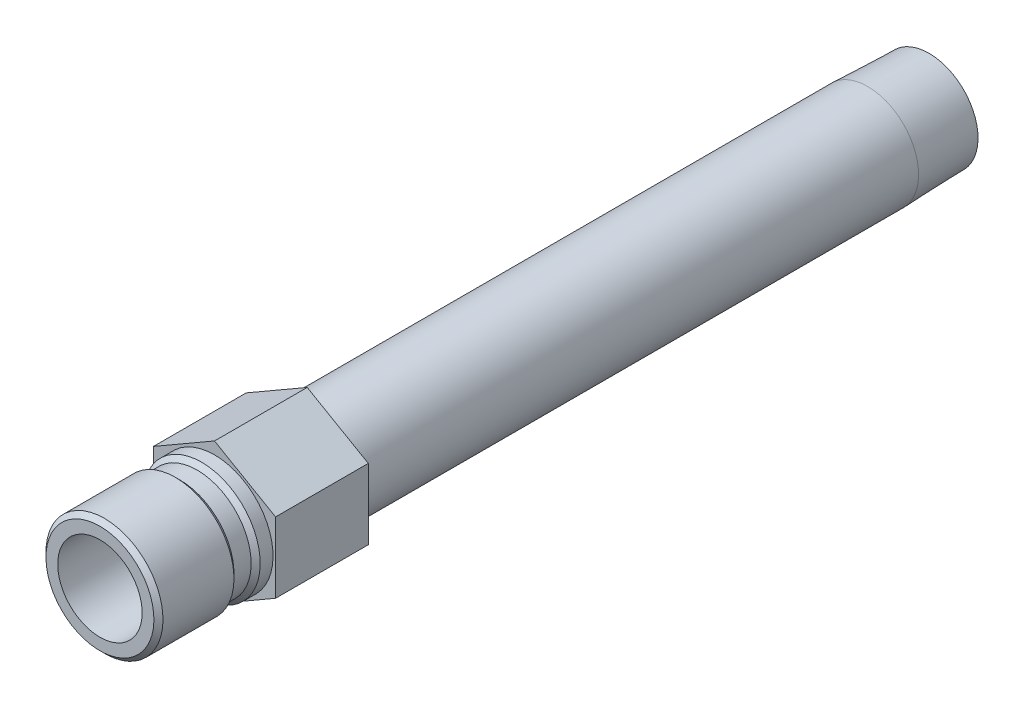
ISO-10303-21;
HEADER;
FILE_DESCRIPTION(('STEP AP214'),'2;1');
FILE_NAME('part.step','',(''),(''),'','','');
FILE_SCHEMA(('AUTOMOTIVE_DESIGN { 1 0 10303 214 1 1 1 1 }'));
ENDSEC;
DATA;
#1=APPLICATION_CONTEXT('core data for automotive mechanical design processes');
#2=APPLICATION_PROTOCOL_DEFINITION('international standard','automotive_design',2000,#1);
#3=PRODUCT_CONTEXT('',#1,'mechanical');
#4=PRODUCT('Part','Part','',(#3));
#5=PRODUCT_RELATED_PRODUCT_CATEGORY('part','',(#4));
#6=PRODUCT_DEFINITION_FORMATION('','',#4);
#7=PRODUCT_DEFINITION_CONTEXT('part definition',#1,'design');
#8=PRODUCT_DEFINITION('design','',#6,#7);
#9=PRODUCT_DEFINITION_SHAPE('','',#8);
#10=(LENGTH_UNIT() NAMED_UNIT(*) SI_UNIT(.MILLI.,.METRE.));
#11=(NAMED_UNIT(*) PLANE_ANGLE_UNIT() SI_UNIT($,.RADIAN.));
#12=(NAMED_UNIT(*) SI_UNIT($,.STERADIAN.) SOLID_ANGLE_UNIT());
#13=UNCERTAINTY_MEASURE_WITH_UNIT(LENGTH_MEASURE(1.E-05),#10,'distance_accuracy_value','');
#14=(GEOMETRIC_REPRESENTATION_CONTEXT(3) GLOBAL_UNCERTAINTY_ASSIGNED_CONTEXT((#13)) GLOBAL_UNIT_ASSIGNED_CONTEXT((#10,
#11,#12)) REPRESENTATION_CONTEXT('',''));
#15=CARTESIAN_POINT('',(0.,0.,0.));
#16=DIRECTION('',(0.,0.,1.));
#17=DIRECTION('',(1.,0.,0.));
#18=AXIS2_PLACEMENT_3D('',#15,#16,#17);
#19=CARTESIAN_POINT('',(0.,0.,0.));
#20=DIRECTION('',(0.,0.,-1.));
#21=DIRECTION('',(0.,1.,0.));
#22=AXIS2_PLACEMENT_3D('',#19,#20,#21);
#23=CYLINDRICAL_SURFACE('',#22,8.5725);
#24=CARTESIAN_POINT('',(0.,0.,-110.0582));
#25=DIRECTION('',(0.,0.,-1.));
#26=DIRECTION('',(0.,1.,0.));
#27=AXIS2_PLACEMENT_3D('',#24,#25,#26);
#28=CIRCLE('',#27,8.5725);
#29=CARTESIAN_POINT('',(0.,8.5725,-110.0582));
#30=VERTEX_POINT('',#29);
#31=EDGE_CURVE('E158',#30,#30,#28,.T.);
#32=ORIENTED_EDGE('',*,*,#31,.F.);
#33=EDGE_LOOP('',(#32));
#34=FACE_BOUND('',#33,.T.);
#35=CARTESIAN_POINT('',(0.,0.,-15.621));
#36=DIRECTION('',(0.,0.,1.));
#37=DIRECTION('',(1.,0.,0.));
#38=AXIS2_PLACEMENT_3D('',#35,#36,#37);
#39=CIRCLE('',#38,8.5725);
#40=CARTESIAN_POINT('',(8.5725,0.,-15.621));
#41=VERTEX_POINT('',#40);
#42=EDGE_CURVE('E39',#41,#41,#39,.F.);
#43=ORIENTED_EDGE('',*,*,#42,.T.);
#44=EDGE_LOOP('',(#43));
#45=FACE_BOUND('',#44,.T.);
#46=ADVANCED_FACE('F35',(#34,#45),#23,.T.);
#47=CARTESIAN_POINT('',(0.,0.,0.));
#48=DIRECTION('',(0.,0.,-1.));
#49=DIRECTION('',(0.,1.,0.));
#50=AXIS2_PLACEMENT_3D('',#47,#48,#49);
#51=CYLINDRICAL_SURFACE('',#50,7.112);
#52=CARTESIAN_POINT('',(0.,0.,1.524));
#53=DIRECTION('',(0.,0.,-1.));
#54=DIRECTION('',(0.,1.,0.));
#55=AXIS2_PLACEMENT_3D('',#52,#53,#54);
#56=CIRCLE('',#55,7.112);
#57=CARTESIAN_POINT('',(0.,7.112,1.524));
#58=VERTEX_POINT('',#57);
#59=EDGE_CURVE('E146',#58,#58,#56,.T.);
#60=ORIENTED_EDGE('',*,*,#59,.T.);
#61=EDGE_LOOP('',(#60));
#62=FACE_BOUND('',#61,.T.);
#63=CARTESIAN_POINT('',(0.,0.,19.304));
#64=DIRECTION('',(0.,0.,-1.));
#65=DIRECTION('',(0.,1.,0.));
#66=AXIS2_PLACEMENT_3D('',#63,#64,#65);
#67=CIRCLE('',#66,7.112);
#68=CARTESIAN_POINT('',(0.,7.112,19.304));
#69=VERTEX_POINT('',#68);
#70=EDGE_CURVE('E11',#69,#69,#67,.T.);
#71=ORIENTED_EDGE('',*,*,#70,.F.);
#72=EDGE_LOOP('',(#71));
#73=FACE_BOUND('',#72,.T.);
#74=ADVANCED_FACE('F37',(#62,#73),#51,.F.);
#75=CARTESIAN_POINT('',(0.,7.112,19.304));
#76=DIRECTION('',(0.,0.,1.));
#77=DIRECTION('',(0.,-1.,0.));
#78=AXIS2_PLACEMENT_3D('',#75,#76,#77);
#79=PLANE('',#78);
#80=ORIENTED_EDGE('',*,*,#70,.T.);
#81=EDGE_LOOP('',(#80));
#82=FACE_BOUND('',#81,.T.);
#83=CARTESIAN_POINT('',(0.,0.,19.304));
#84=DIRECTION('',(0.,0.,-1.));
#85=DIRECTION('',(0.,1.,0.));
#86=AXIS2_PLACEMENT_3D('',#83,#84,#85);
#87=CIRCLE('',#86,9.09319999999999);
#88=CARTESIAN_POINT('',(0.,9.0932,19.304));
#89=VERTEX_POINT('',#88);
#90=EDGE_CURVE('E45',#89,#89,#87,.T.);
#91=ORIENTED_EDGE('',*,*,#90,.F.);
#92=EDGE_LOOP('',(#91));
#93=FACE_BOUND('',#92,.T.);
#94=ADVANCED_FACE('F185',(#82,#93),#79,.T.);
#95=CARTESIAN_POINT('',(0.,0.,18.542));
#96=DIRECTION('',(0.,0.,-1.));
#97=DIRECTION('',(0.,1.,0.));
#98=AXIS2_PLACEMENT_3D('',#95,#96,#97);
#99=CONICAL_SURFACE('',#98,9.8552,0.785398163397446);
#100=ORIENTED_EDGE('',*,*,#90,.T.);
#101=EDGE_LOOP('',(#100));
#102=FACE_BOUND('',#101,.T.);
#103=CARTESIAN_POINT('',(0.,0.,18.542));
#104=DIRECTION('',(0.,0.,-1.));
#105=DIRECTION('',(0.,1.,0.));
#106=AXIS2_PLACEMENT_3D('',#103,#104,#105);
#107=CIRCLE('',#106,9.8552);
#108=CARTESIAN_POINT('',(0.,9.8552,18.542));
#109=VERTEX_POINT('',#108);
#110=EDGE_CURVE('E176',#109,#109,#107,.T.);
#111=ORIENTED_EDGE('',*,*,#110,.F.);
#112=EDGE_LOOP('',(#111));
#113=FACE_BOUND('',#112,.T.);
#114=ADVANCED_FACE('F182',(#102,#113),#99,.T.);
#115=CARTESIAN_POINT('',(0.,0.,0.));
#116=DIRECTION('',(0.,0.,-1.));
#117=DIRECTION('',(0.,1.,0.));
#118=AXIS2_PLACEMENT_3D('',#115,#116,#117);
#119=CYLINDRICAL_SURFACE('',#118,9.8552);
#120=ORIENTED_EDGE('',*,*,#110,.T.);
#121=EDGE_LOOP('',(#120));
#122=FACE_BOUND('',#121,.T.);
#123=CARTESIAN_POINT('',(0.,0.,6.5786));
#124=DIRECTION('',(0.,0.,-1.));
#125=DIRECTION('',(0.,1.,0.));
#126=AXIS2_PLACEMENT_3D('',#123,#124,#125);
#127=CIRCLE('',#126,9.8552);
#128=CARTESIAN_POINT('',(0.,9.8552,6.5786));
#129=VERTEX_POINT('',#128);
#130=EDGE_CURVE('E173',#129,#129,#127,.T.);
#131=ORIENTED_EDGE('',*,*,#130,.F.);
#132=EDGE_LOOP('',(#131));
#133=FACE_BOUND('',#132,.T.);
#134=ADVANCED_FACE('F192',(#122,#133),#119,.T.);
#135=CARTESIAN_POINT('',(0.,0.,5.8166));
#136=DIRECTION('',(0.,0.,1.));
#137=DIRECTION('',(0.,-1.,0.));
#138=AXIS2_PLACEMENT_3D('',#135,#136,#137);
#139=CONICAL_SURFACE('',#138,9.0932,0.785398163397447);
#140=ORIENTED_EDGE('',*,*,#130,.T.);
#141=EDGE_LOOP('',(#140));
#142=FACE_BOUND('',#141,.T.);
#143=CARTESIAN_POINT('',(0.,0.,5.8166));
#144=DIRECTION('',(0.,0.,-1.));
#145=DIRECTION('',(0.,1.,0.));
#146=AXIS2_PLACEMENT_3D('',#143,#144,#145);
#147=CIRCLE('',#146,9.0932);
#148=CARTESIAN_POINT('',(0.,9.0932,5.8166));
#149=VERTEX_POINT('',#148);
#150=EDGE_CURVE('E170',#149,#149,#147,.T.);
#151=ORIENTED_EDGE('',*,*,#150,.F.);
#152=EDGE_LOOP('',(#151));
#153=FACE_BOUND('',#152,.T.);
#154=ADVANCED_FACE('F217',(#142,#153),#139,.T.);
#155=CARTESIAN_POINT('',(0.,0.,0.));
#156=DIRECTION('',(0.,0.,-1.));
#157=DIRECTION('',(0.,1.,0.));
#158=AXIS2_PLACEMENT_3D('',#155,#156,#157);
#159=CYLINDRICAL_SURFACE('',#158,9.0932);
#160=ORIENTED_EDGE('',*,*,#150,.T.);
#161=EDGE_LOOP('',(#160));
#162=FACE_BOUND('',#161,.T.);
#163=CARTESIAN_POINT('',(0.,0.,2.921));
#164=DIRECTION('',(0.,0.,-1.));
#165=DIRECTION('',(0.,1.,0.));
#166=AXIS2_PLACEMENT_3D('',#163,#164,#165);
#167=CIRCLE('',#166,9.0932);
#168=CARTESIAN_POINT('',(0.,9.0932,2.921));
#169=VERTEX_POINT('',#168);
#170=EDGE_CURVE('E167',#169,#169,#167,.T.);
#171=ORIENTED_EDGE('',*,*,#170,.F.);
#172=EDGE_LOOP('',(#171));
#173=FACE_BOUND('',#172,.T.);
#174=ADVANCED_FACE('F213',(#162,#173),#159,.T.);
#175=CARTESIAN_POINT('',(0.,0.,2.159));
#176=DIRECTION('',(0.,0.,-1.));
#177=DIRECTION('',(0.,1.,0.));
#178=AXIS2_PLACEMENT_3D('',#175,#176,#177);
#179=CONICAL_SURFACE('',#178,9.8552,0.785398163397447);
#180=ORIENTED_EDGE('',*,*,#170,.T.);
#181=EDGE_LOOP('',(#180));
#182=FACE_BOUND('',#181,.T.);
#183=CARTESIAN_POINT('',(0.,0.,2.159));
#184=DIRECTION('',(0.,0.,-1.));
#185=DIRECTION('',(0.,1.,0.));
#186=AXIS2_PLACEMENT_3D('',#183,#184,#185);
#187=CIRCLE('',#186,9.8552);
#188=CARTESIAN_POINT('',(0.,9.8552,2.159));
#189=VERTEX_POINT('',#188);
#190=EDGE_CURVE('E164',#189,#189,#187,.T.);
#191=ORIENTED_EDGE('',*,*,#190,.F.);
#192=EDGE_LOOP('',(#191));
#193=FACE_BOUND('',#192,.T.);
#194=ADVANCED_FACE('F209',(#182,#193),#179,.T.);
#195=CARTESIAN_POINT('',(0.,0.,0.));
#196=DIRECTION('',(0.,0.,-1.));
#197=DIRECTION('',(0.,1.,0.));
#198=AXIS2_PLACEMENT_3D('',#195,#196,#197);
#199=CYLINDRICAL_SURFACE('',#198,9.8552);
#200=ORIENTED_EDGE('',*,*,#190,.T.);
#201=EDGE_LOOP('',(#200));
#202=FACE_BOUND('',#201,.T.);
#203=CARTESIAN_POINT('',(0.,0.,0.));
#204=DIRECTION('',(0.,0.,-1.));
#205=DIRECTION('',(0.,1.,0.));
#206=AXIS2_PLACEMENT_3D('',#203,#204,#205);
#207=CIRCLE('',#206,9.8552);
#208=CARTESIAN_POINT('',(0.,9.8552,0.));
#209=VERTEX_POINT('',#208);
#210=EDGE_CURVE('E161',#209,#209,#207,.T.);
#211=ORIENTED_EDGE('',*,*,#210,.F.);
#212=EDGE_LOOP('',(#211));
#213=FACE_BOUND('',#212,.T.);
#214=ADVANCED_FACE('F206',(#202,#213),#199,.T.);
#215=CARTESIAN_POINT('',(0.,0.,-120.396));
#216=DIRECTION('',(0.,0.,1.));
#217=DIRECTION('',(0.,-1.,0.));
#218=AXIS2_PLACEMENT_3D('',#215,#216,#217);
#219=CONICAL_SURFACE('',#218,8.24944566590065,0.0312396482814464);
#220=ORIENTED_EDGE('',*,*,#31,.T.);
#221=EDGE_LOOP('',(#220));
#222=FACE_BOUND('',#221,.T.);
#223=CARTESIAN_POINT('',(0.,0.,-120.396));
#224=DIRECTION('',(0.,0.,-1.));
#225=DIRECTION('',(0.,1.,0.));
#226=AXIS2_PLACEMENT_3D('',#223,#224,#225);
#227=CIRCLE('',#226,8.24944566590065);
#228=CARTESIAN_POINT('',(0.,8.24944566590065,-120.396));
#229=VERTEX_POINT('',#228);
#230=EDGE_CURVE('E155',#229,#229,#227,.T.);
#231=ORIENTED_EDGE('',*,*,#230,.F.);
#232=EDGE_LOOP('',(#231));
#233=FACE_BOUND('',#232,.T.);
#234=ADVANCED_FACE('F204',(#222,#233),#219,.T.);
#235=CARTESIAN_POINT('',(0.,8.24944566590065,-120.396));
#236=DIRECTION('',(0.,0.,-1.));
#237=DIRECTION('',(0.,1.,0.));
#238=AXIS2_PLACEMENT_3D('',#235,#236,#237);
#239=PLANE('',#238);
#240=ORIENTED_EDGE('',*,*,#230,.T.);
#241=EDGE_LOOP('',(#240));
#242=FACE_BOUND('',#241,.T.);
#243=CARTESIAN_POINT('',(0.,0.,-120.396));
#244=DIRECTION('',(0.,0.,-1.));
#245=DIRECTION('',(0.,1.,0.));
#246=AXIS2_PLACEMENT_3D('',#243,#244,#245);
#247=CIRCLE('',#246,6.2611);
#248=CARTESIAN_POINT('',(0.,6.2611,-120.396));
#249=VERTEX_POINT('',#248);
#250=EDGE_CURVE('E152',#249,#249,#247,.T.);
#251=ORIENTED_EDGE('',*,*,#250,.F.);
#252=EDGE_LOOP('',(#251));
#253=FACE_BOUND('',#252,.T.);
#254=ADVANCED_FACE('F270',(#242,#253),#239,.T.);
#255=CARTESIAN_POINT('',(0.,0.,0.));
#256=DIRECTION('',(0.,0.,-1.));
#257=DIRECTION('',(0.,1.,0.));
#258=AXIS2_PLACEMENT_3D('',#255,#256,#257);
#259=CYLINDRICAL_SURFACE('',#258,6.2611);
#260=ORIENTED_EDGE('',*,*,#250,.T.);
#261=EDGE_LOOP('',(#260));
#262=FACE_BOUND('',#261,.T.);
#263=CARTESIAN_POINT('',(0.,0.,1.07156844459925));
#264=DIRECTION('',(0.,0.,-1.));
#265=DIRECTION('',(0.,1.,0.));
#266=AXIS2_PLACEMENT_3D('',#263,#264,#265);
#267=CIRCLE('',#266,6.2611);
#268=CARTESIAN_POINT('',(0.,6.2611,1.07156844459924));
#269=VERTEX_POINT('',#268);
#270=EDGE_CURVE('E149',#269,#269,#267,.T.);
#271=ORIENTED_EDGE('',*,*,#270,.F.);
#272=EDGE_LOOP('',(#271));
#273=FACE_BOUND('',#272,.T.);
#274=ADVANCED_FACE('F267',(#262,#273),#259,.F.);
#275=CARTESIAN_POINT('',(0.,0.,1.524));
#276=DIRECTION('',(0.,0.,1.));
#277=DIRECTION('',(0.,-1.,0.));
#278=AXIS2_PLACEMENT_3D('',#275,#276,#277);
#279=CONICAL_SURFACE('',#278,7.112,1.08210413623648);
#280=ORIENTED_EDGE('',*,*,#270,.T.);
#281=EDGE_LOOP('',(#280));
#282=FACE_BOUND('',#281,.T.);
#283=ORIENTED_EDGE('',*,*,#59,.F.);
#284=EDGE_LOOP('',(#283));
#285=FACE_BOUND('',#284,.T.);
#286=ADVANCED_FACE('F255',(#282,#285),#279,.F.);
#287=CARTESIAN_POINT('',(0.,11.8784044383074,-15.621));
#288=DIRECTION('',(-0.5,0.866025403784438,0.));
#289=DIRECTION('',(-0.866025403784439,-0.5,0.));
#290=AXIS2_PLACEMENT_3D('',#287,#288,#289);
#291=PLANE('',#290);
#292=DIRECTION('',(-0.866025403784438,-0.5,0.));
#293=VECTOR('',#292,1.);
#294=CARTESIAN_POINT('',(0.,11.8784044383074,0.));
#295=LINE('',#294,#293);
#296=CARTESIAN_POINT('',(0.,11.8784044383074,0.));
#297=VERTEX_POINT('',#296);
#298=CARTESIAN_POINT('',(-10.287,5.93920221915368,0.));
#299=VERTEX_POINT('',#298);
#300=EDGE_CURVE('E124',#297,#299,#295,.T.);
#301=ORIENTED_EDGE('',*,*,#300,.F.);
#302=DIRECTION('',(0.,0.,1.));
#303=VECTOR('',#302,1.);
#304=CARTESIAN_POINT('',(0.,11.8784044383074,-15.621));
#305=LINE('',#304,#303);
#306=CARTESIAN_POINT('',(0.,11.8784044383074,-15.621));
#307=VERTEX_POINT('',#306);
#308=EDGE_CURVE('E53',#307,#297,#305,.T.);
#309=ORIENTED_EDGE('',*,*,#308,.F.);
#310=DIRECTION('',(-0.866025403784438,-0.5,0.));
#311=VECTOR('',#310,1.);
#312=CARTESIAN_POINT('',(0.,11.8784044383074,-15.621));
#313=LINE('',#312,#311);
#314=CARTESIAN_POINT('',(-10.287,5.93920221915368,-15.621));
#315=VERTEX_POINT('',#314);
#316=EDGE_CURVE('E139',#307,#315,#313,.T.);
#317=ORIENTED_EDGE('',*,*,#316,.T.);
#318=DIRECTION('',(0.,0.,1.));
#319=VECTOR('',#318,1.);
#320=CARTESIAN_POINT('',(-10.287,5.93920221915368,-15.621));
#321=LINE('',#320,#319);
#322=EDGE_CURVE('E88',#315,#299,#321,.T.);
#323=ORIENTED_EDGE('',*,*,#322,.T.);
#324=EDGE_LOOP('',(#301,#309,#317,#323));
#325=FACE_BOUND('',#324,.T.);
#326=ADVANCED_FACE('F242',(#325),#291,.T.);
#327=CARTESIAN_POINT('',(10.287,5.93920221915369,-15.621));
#328=DIRECTION('',(0.5,0.866025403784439,0.));
#329=DIRECTION('',(-0.866025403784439,0.5,0.));
#330=AXIS2_PLACEMENT_3D('',#327,#328,#329);
#331=PLANE('',#330);
#332=DIRECTION('',(-0.866025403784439,0.5,0.));
#333=VECTOR('',#332,1.);
#334=CARTESIAN_POINT('',(10.287,5.93920221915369,0.));
#335=LINE('',#334,#333);
#336=CARTESIAN_POINT('',(10.287,5.93920221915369,0.));
#337=VERTEX_POINT('',#336);
#338=EDGE_CURVE('E136',#337,#297,#335,.T.);
#339=ORIENTED_EDGE('',*,*,#338,.F.);
#340=DIRECTION('',(0.,0.,1.));
#341=VECTOR('',#340,1.);
#342=CARTESIAN_POINT('',(10.287,5.93920221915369,-15.621));
#343=LINE('',#342,#341);
#344=CARTESIAN_POINT('',(10.287,5.93920221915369,-15.621));
#345=VERTEX_POINT('',#344);
#346=EDGE_CURVE('E76',#345,#337,#343,.T.);
#347=ORIENTED_EDGE('',*,*,#346,.F.);
#348=DIRECTION('',(-0.866025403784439,0.5,0.));
#349=VECTOR('',#348,1.);
#350=CARTESIAN_POINT('',(10.287,5.93920221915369,-15.621));
#351=LINE('',#350,#349);
#352=EDGE_CURVE('E114',#345,#307,#351,.T.);
#353=ORIENTED_EDGE('',*,*,#352,.T.);
#354=ORIENTED_EDGE('',*,*,#308,.T.);
#355=EDGE_LOOP('',(#339,#347,#353,#354));
#356=FACE_BOUND('',#355,.T.);
#357=ADVANCED_FACE('F247',(#356),#331,.T.);
#358=CARTESIAN_POINT('',(10.287,-5.93920221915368,-15.621));
#359=DIRECTION('',(1.,0.,0.));
#360=DIRECTION('',(0.,0.,-1.));
#361=AXIS2_PLACEMENT_3D('',#358,#359,#360);
#362=PLANE('',#361);
#363=DIRECTION('',(0.,1.,0.));
#364=VECTOR('',#363,1.);
#365=CARTESIAN_POINT('',(10.287,-5.93920221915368,0.));
#366=LINE('',#365,#364);
#367=CARTESIAN_POINT('',(10.287,-5.93920221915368,0.));
#368=VERTEX_POINT('',#367);
#369=EDGE_CURVE('E101',#368,#337,#366,.T.);
#370=ORIENTED_EDGE('',*,*,#369,.F.);
#371=DIRECTION('',(0.,0.,1.));
#372=VECTOR('',#371,1.);
#373=CARTESIAN_POINT('',(10.287,-5.93920221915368,-15.621));
#374=LINE('',#373,#372);
#375=CARTESIAN_POINT('',(10.287,-5.93920221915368,-15.621));
#376=VERTEX_POINT('',#375);
#377=EDGE_CURVE('E96',#376,#368,#374,.T.);
#378=ORIENTED_EDGE('',*,*,#377,.F.);
#379=DIRECTION('',(0.,1.,0.));
#380=VECTOR('',#379,1.);
#381=CARTESIAN_POINT('',(10.287,-5.93920221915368,-15.621));
#382=LINE('',#381,#380);
#383=EDGE_CURVE('E99',#376,#345,#382,.T.);
#384=ORIENTED_EDGE('',*,*,#383,.T.);
#385=ORIENTED_EDGE('',*,*,#346,.T.);
#386=EDGE_LOOP('',(#370,#378,#384,#385));
#387=FACE_BOUND('',#386,.T.);
#388=ADVANCED_FACE('F98',(#387),#362,.T.);
#389=CARTESIAN_POINT('',(0.,-11.8784044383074,-15.621));
#390=DIRECTION('',(0.5,-0.866025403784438,0.));
#391=DIRECTION('',(0.866025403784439,0.5,0.));
#392=AXIS2_PLACEMENT_3D('',#389,#390,#391);
#393=PLANE('',#392);
#394=DIRECTION('',(0.866025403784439,0.5,0.));
#395=VECTOR('',#394,1.);
#396=CARTESIAN_POINT('',(0.,-11.8784044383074,0.));
#397=LINE('',#396,#395);
#398=CARTESIAN_POINT('',(0.,-11.8784044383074,0.));
#399=VERTEX_POINT('',#398);
#400=EDGE_CURVE('E133',#399,#368,#397,.T.);
#401=ORIENTED_EDGE('',*,*,#400,.F.);
#402=DIRECTION('',(0.,0.,1.));
#403=VECTOR('',#402,1.);
#404=CARTESIAN_POINT('',(0.,-11.8784044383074,-15.621));
#405=LINE('',#404,#403);
#406=CARTESIAN_POINT('',(0.,-11.8784044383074,-15.621));
#407=VERTEX_POINT('',#406);
#408=EDGE_CURVE('E106',#407,#399,#405,.T.);
#409=ORIENTED_EDGE('',*,*,#408,.F.);
#410=DIRECTION('',(0.866025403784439,0.5,0.));
#411=VECTOR('',#410,1.);
#412=CARTESIAN_POINT('',(0.,-11.8784044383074,-15.621));
#413=LINE('',#412,#411);
#414=EDGE_CURVE('E112',#407,#376,#413,.T.);
#415=ORIENTED_EDGE('',*,*,#414,.T.);
#416=ORIENTED_EDGE('',*,*,#377,.T.);
#417=EDGE_LOOP('',(#401,#409,#415,#416));
#418=FACE_BOUND('',#417,.T.);
#419=ADVANCED_FACE('F116',(#418),#393,.T.);
#420=CARTESIAN_POINT('',(-10.287,-5.93920221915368,-15.621));
#421=DIRECTION('',(-0.5,-0.866025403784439,0.));
#422=DIRECTION('',(0.866025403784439,-0.5,0.));
#423=AXIS2_PLACEMENT_3D('',#420,#421,#422);
#424=PLANE('',#423);
#425=DIRECTION('',(0.866025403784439,-0.5,0.));
#426=VECTOR('',#425,1.);
#427=CARTESIAN_POINT('',(-10.287,-5.93920221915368,0.));
#428=LINE('',#427,#426);
#429=CARTESIAN_POINT('',(-10.287,-5.93920221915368,0.));
#430=VERTEX_POINT('',#429);
#431=EDGE_CURVE('E130',#430,#399,#428,.T.);
#432=ORIENTED_EDGE('',*,*,#431,.F.);
#433=DIRECTION('',(0.,0.,1.));
#434=VECTOR('',#433,1.);
#435=CARTESIAN_POINT('',(-10.287,-5.93920221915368,-15.621));
#436=LINE('',#435,#434);
#437=CARTESIAN_POINT('',(-10.287,-5.93920221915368,-15.621));
#438=VERTEX_POINT('',#437);
#439=EDGE_CURVE('E143',#438,#430,#436,.T.);
#440=ORIENTED_EDGE('',*,*,#439,.F.);
#441=DIRECTION('',(0.866025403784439,-0.5,0.));
#442=VECTOR('',#441,1.);
#443=CARTESIAN_POINT('',(-10.287,-5.93920221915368,-15.621));
#444=LINE('',#443,#442);
#445=EDGE_CURVE('E117',#438,#407,#444,.T.);
#446=ORIENTED_EDGE('',*,*,#445,.T.);
#447=ORIENTED_EDGE('',*,*,#408,.T.);
#448=EDGE_LOOP('',(#432,#440,#446,#447));
#449=FACE_BOUND('',#448,.T.);
#450=ADVANCED_FACE('F246',(#449),#424,.T.);
#451=CARTESIAN_POINT('',(-10.287,5.93920221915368,-15.621));
#452=DIRECTION('',(-1.,0.,0.));
#453=DIRECTION('',(0.,0.,1.));
#454=AXIS2_PLACEMENT_3D('',#451,#452,#453);
#455=PLANE('',#454);
#456=DIRECTION('',(0.,-1.,0.));
#457=VECTOR('',#456,1.);
#458=CARTESIAN_POINT('',(-10.287,5.93920221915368,0.));
#459=LINE('',#458,#457);
#460=EDGE_CURVE('E127',#299,#430,#459,.T.);
#461=ORIENTED_EDGE('',*,*,#460,.F.);
#462=ORIENTED_EDGE('',*,*,#322,.F.);
#463=DIRECTION('',(0.,-1.,0.));
#464=VECTOR('',#463,1.);
#465=CARTESIAN_POINT('',(-10.287,5.93920221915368,-15.621));
#466=LINE('',#465,#464);
#467=EDGE_CURVE('E119',#315,#438,#466,.T.);
#468=ORIENTED_EDGE('',*,*,#467,.T.);
#469=ORIENTED_EDGE('',*,*,#439,.T.);
#470=EDGE_LOOP('',(#461,#462,#468,#469));
#471=FACE_BOUND('',#470,.T.);
#472=ADVANCED_FACE('F243',(#471),#455,.T.);
#473=CARTESIAN_POINT('',(-10.287,5.93920221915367,-15.621));
#474=DIRECTION('',(0.,0.,1.));
#475=DIRECTION('',(1.,0.,0.));
#476=AXIS2_PLACEMENT_3D('',#473,#474,#475);
#477=PLANE('',#476);
#478=ORIENTED_EDGE('',*,*,#42,.F.);
#479=EDGE_LOOP('',(#478));
#480=FACE_BOUND('',#479,.T.);
#481=ORIENTED_EDGE('',*,*,#316,.F.);
#482=ORIENTED_EDGE('',*,*,#352,.F.);
#483=ORIENTED_EDGE('',*,*,#383,.F.);
#484=ORIENTED_EDGE('',*,*,#414,.F.);
#485=ORIENTED_EDGE('',*,*,#445,.F.);
#486=ORIENTED_EDGE('',*,*,#467,.F.);
#487=EDGE_LOOP('',(#481,#482,#483,#484,#485,#486));
#488=FACE_BOUND('',#487,.T.);
#489=ADVANCED_FACE('F110',(#480,#488),#477,.F.);
#490=CARTESIAN_POINT('',(-10.287,5.93920221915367,0.));
#491=DIRECTION('',(0.,0.,1.));
#492=DIRECTION('',(1.,0.,0.));
#493=AXIS2_PLACEMENT_3D('',#490,#491,#492);
#494=PLANE('',#493);
#495=ORIENTED_EDGE('',*,*,#210,.T.);
#496=EDGE_LOOP('',(#495));
#497=FACE_BOUND('',#496,.T.);
#498=ORIENTED_EDGE('',*,*,#300,.T.);
#499=ORIENTED_EDGE('',*,*,#460,.T.);
#500=ORIENTED_EDGE('',*,*,#431,.T.);
#501=ORIENTED_EDGE('',*,*,#400,.T.);
#502=ORIENTED_EDGE('',*,*,#369,.T.);
#503=ORIENTED_EDGE('',*,*,#338,.T.);
#504=EDGE_LOOP('',(#498,#499,#500,#501,#502,#503));
#505=FACE_BOUND('',#504,.T.);
#506=ADVANCED_FACE('F238',(#497,#505),#494,.T.);
#507=CLOSED_SHELL('',(#46,#74,#94,#114,#134,#154,#174,#194,#214,#234,#254,#274,#286,#326,#357,
#388,#419,#450,#472,#489,#506));
#508=MANIFOLD_SOLID_BREP('B2',#507);
#509=ADVANCED_BREP_SHAPE_REPRESENTATION('',(#18,#508),#14);
#510=SHAPE_DEFINITION_REPRESENTATION(#9,#509);
ENDSEC;
END-ISO-10303-21;
